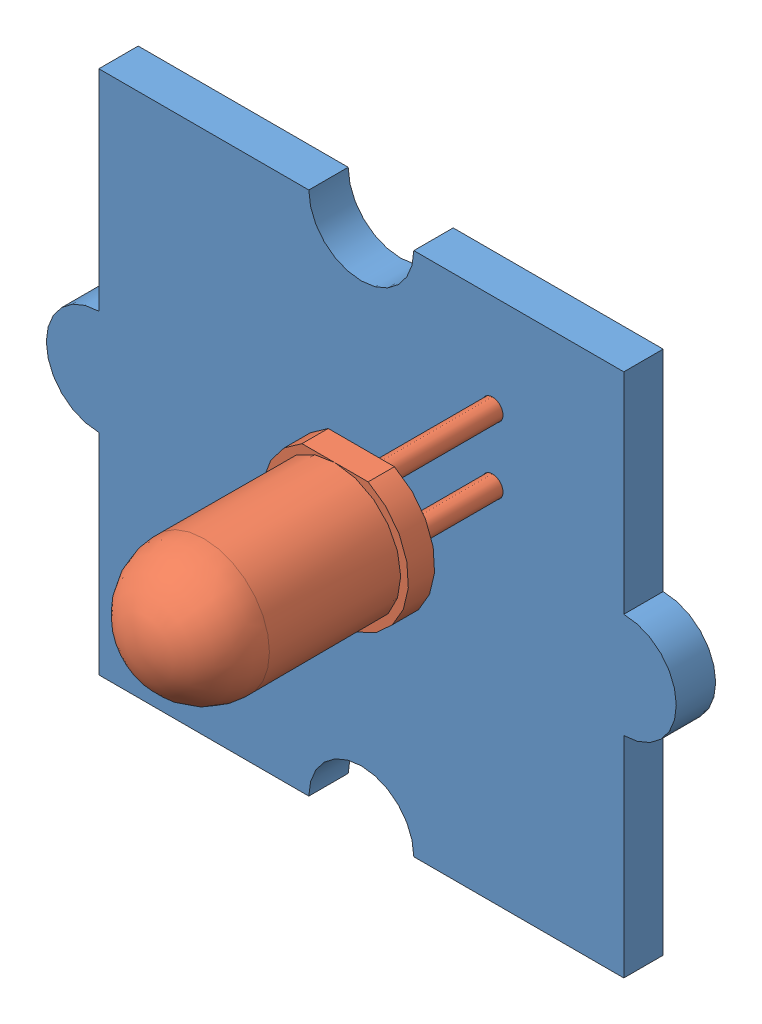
SolidWorks assembly Assemblage_support+led.SLDASM, configuration Défaut (file format 8000). Lengths in mm.
Overall size (24 20 15).
2 component instances, 2 part files, 4 mates.
Components (placement in the parent):
- support_led-1: support_led.SLDPRT [Défaut] at (-90.6417 -2.8033 -0.75) size (24 20 1.5)
- DEL D5-1: DEL D5.SLDPRT [Défaut] at (-75.6417 12.1967 14.25) x (0 1 0) z (0 0 -1) size (5.3 5.6 15)
Mates (geometry in assembly coordinates):
- Parallèle1: parallel anti-aligned: plane of support_led-1 through (-90.6417 7.1967 0.75) normal (0 0 1); plane of DEL D5-1 through (-75.6417 12.1967 5.75) normal (0 0 -1)
- Coaxiale1: concentric anti-aligned: circle of support_led-1; circle of DEL D5-1
- Distance1: distance = 5 mm anti-aligned: plane of support_led-1 through (-90.6417 7.1967 0.75) normal (0 0 1); plane of DEL D5-1 through (-75.6417 12.1967 5.75) normal (0 0 -1)
- Coaxiale2: concentric anti-aligned: circle of support_led-1; circle of DEL D5-1
